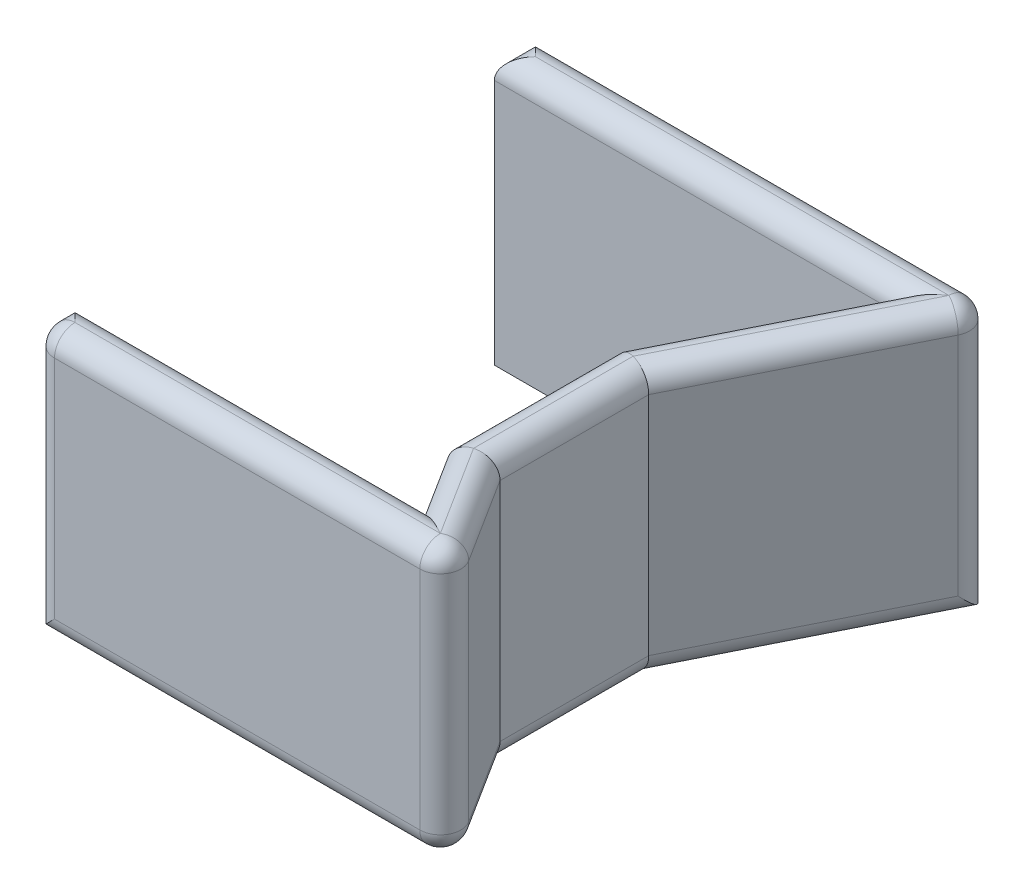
ISO-10303-21;
HEADER;
FILE_DESCRIPTION(('STEP AP214'),'2;1');
FILE_NAME('part.step','',(''),(''),'','','');
FILE_SCHEMA(('AUTOMOTIVE_DESIGN { 1 0 10303 214 1 1 1 1 }'));
ENDSEC;
DATA;
#1=APPLICATION_CONTEXT('core data for automotive mechanical design processes');
#2=APPLICATION_PROTOCOL_DEFINITION('international standard','automotive_design',2000,#1);
#3=PRODUCT_CONTEXT('',#1,'mechanical');
#4=PRODUCT('Part','Part','',(#3));
#5=PRODUCT_RELATED_PRODUCT_CATEGORY('part','',(#4));
#6=PRODUCT_DEFINITION_FORMATION('','',#4);
#7=PRODUCT_DEFINITION_CONTEXT('part definition',#1,'design');
#8=PRODUCT_DEFINITION('design','',#6,#7);
#9=PRODUCT_DEFINITION_SHAPE('','',#8);
#10=(LENGTH_UNIT() NAMED_UNIT(*) SI_UNIT(.MILLI.,.METRE.));
#11=(NAMED_UNIT(*) PLANE_ANGLE_UNIT() SI_UNIT($,.RADIAN.));
#12=(NAMED_UNIT(*) SI_UNIT($,.STERADIAN.) SOLID_ANGLE_UNIT());
#13=UNCERTAINTY_MEASURE_WITH_UNIT(LENGTH_MEASURE(1.E-05),#10,'distance_accuracy_value','');
#14=(GEOMETRIC_REPRESENTATION_CONTEXT(3) GLOBAL_UNCERTAINTY_ASSIGNED_CONTEXT((#13)) GLOBAL_UNIT_ASSIGNED_CONTEXT((#10,
#11,#12)) REPRESENTATION_CONTEXT('',''));
#15=CARTESIAN_POINT('',(0.,0.,0.));
#16=DIRECTION('',(0.,0.,1.));
#17=DIRECTION('',(1.,0.,0.));
#18=AXIS2_PLACEMENT_3D('',#15,#16,#17);
#19=CARTESIAN_POINT('',(12.0356371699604,130.,49.1694012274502));
#20=DIRECTION('',(0.,0.,1.));
#21=DIRECTION('',(1.,0.,0.));
#22=AXIS2_PLACEMENT_3D('',#19,#20,#21);
#23=PLANE('',#22);
#24=DIRECTION('',(0.,-1.,0.));
#25=VECTOR('',#24,1.);
#26=CARTESIAN_POINT('',(-175.757482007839,130.,49.1694012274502));
#27=LINE('',#26,#25);
#28=CARTESIAN_POINT('',(-175.757482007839,120.,49.1694012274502));
#29=VERTEX_POINT('',#28);
#30=CARTESIAN_POINT('',(-175.757482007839,0.,49.1694012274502));
#31=VERTEX_POINT('',#30);
#32=EDGE_CURVE('E339',#29,#31,#27,.T.);
#33=ORIENTED_EDGE('',*,*,#32,.F.);
#34=DIRECTION('',(-1.,0.,0.));
#35=VECTOR('',#34,1.);
#36=CARTESIAN_POINT('',(12.0356371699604,120.,49.1694012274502));
#37=LINE('',#36,#35);
#38=CARTESIAN_POINT('',(-6.12149708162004,120.,49.1694012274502));
#39=VERTEX_POINT('',#38);
#40=EDGE_CURVE('E356',#29,#39,#37,.F.);
#41=ORIENTED_EDGE('',*,*,#40,.T.);
#42=DIRECTION('',(0.,-1.,0.));
#43=VECTOR('',#42,1.);
#44=CARTESIAN_POINT('',(-6.12149708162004,130.,49.1694012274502));
#45=LINE('',#44,#43);
#46=CARTESIAN_POINT('',(-6.12149708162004,0.,49.1694012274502));
#47=VERTEX_POINT('',#46);
#48=EDGE_CURVE('E327',#39,#47,#45,.T.);
#49=ORIENTED_EDGE('',*,*,#48,.T.);
#50=DIRECTION('',(-1.,0.,0.));
#51=VECTOR('',#50,1.);
#52=CARTESIAN_POINT('',(12.0356371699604,0.,49.1694012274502));
#53=LINE('',#52,#51);
#54=EDGE_CURVE('E298',#47,#31,#53,.T.);
#55=ORIENTED_EDGE('',*,*,#54,.T.);
#56=EDGE_LOOP('',(#33,#41,#49,#55));
#57=FACE_BOUND('',#56,.T.);
#58=ADVANCED_FACE('F33',(#57),#23,.F.);
#59=CARTESIAN_POINT('',(-175.757482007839,130.,69.1694012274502));
#60=DIRECTION('',(-1.,0.,0.));
#61=DIRECTION('',(0.,0.,1.));
#62=AXIS2_PLACEMENT_3D('',#59,#60,#61);
#63=PLANE('',#62);
#64=DIRECTION('',(0.,-1.,0.));
#65=VECTOR('',#64,1.);
#66=CARTESIAN_POINT('',(-175.757482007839,130.,59.1694012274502));
#67=LINE('',#66,#65);
#68=CARTESIAN_POINT('',(-175.757482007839,0.,59.1694012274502));
#69=VERTEX_POINT('',#68);
#70=CARTESIAN_POINT('',(-175.757482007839,120.,59.1694012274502));
#71=VERTEX_POINT('',#70);
#72=EDGE_CURVE('E358',#69,#71,#67,.F.);
#73=ORIENTED_EDGE('',*,*,#72,.T.);
#74=DIRECTION('',(0.,0.,-1.));
#75=VECTOR('',#74,1.);
#76=CARTESIAN_POINT('',(-175.757482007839,120.,49.1694012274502));
#77=LINE('',#76,#75);
#78=EDGE_CURVE('E360',#71,#29,#77,.T.);
#79=ORIENTED_EDGE('',*,*,#78,.T.);
#80=ORIENTED_EDGE('',*,*,#32,.T.);
#81=DIRECTION('',(0.,0.,-1.));
#82=VECTOR('',#81,1.);
#83=CARTESIAN_POINT('',(-175.757482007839,0.,69.1694012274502));
#84=LINE('',#83,#82);
#85=EDGE_CURVE('E91',#69,#31,#84,.T.);
#86=ORIENTED_EDGE('',*,*,#85,.F.);
#87=EDGE_LOOP('',(#73,#79,#80,#86));
#88=FACE_BOUND('',#87,.T.);
#89=ADVANCED_FACE('F449',(#88),#63,.T.);
#90=CARTESIAN_POINT('',(12.0356371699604,130.,69.1694012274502));
#91=DIRECTION('',(0.,0.,1.));
#92=DIRECTION('',(1.,0.,0.));
#93=AXIS2_PLACEMENT_3D('',#90,#91,#92);
#94=PLANE('',#93);
#95=DIRECTION('',(0.,-1.,0.));
#96=VECTOR('',#95,1.);
#97=CARTESIAN_POINT('',(12.0356371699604,130.,69.1694012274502));
#98=LINE('',#97,#96);
#99=CARTESIAN_POINT('',(12.0356371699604,10.,69.1694012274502));
#100=VERTEX_POINT('',#99);
#101=CARTESIAN_POINT('',(12.0356371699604,120.,69.1694012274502));
#102=VERTEX_POINT('',#101);
#103=EDGE_CURVE('E362',#100,#102,#98,.F.);
#104=ORIENTED_EDGE('',*,*,#103,.T.);
#105=DIRECTION('',(-1.,0.,0.));
#106=VECTOR('',#105,1.);
#107=CARTESIAN_POINT('',(-175.757482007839,120.,69.1694012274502));
#108=LINE('',#107,#106);
#109=CARTESIAN_POINT('',(-165.757482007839,120.,69.1694012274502));
#110=VERTEX_POINT('',#109);
#111=EDGE_CURVE('E368',#102,#110,#108,.T.);
#112=ORIENTED_EDGE('',*,*,#111,.T.);
#113=DIRECTION('',(0.,-1.,0.));
#114=VECTOR('',#113,1.);
#115=CARTESIAN_POINT('',(-165.757482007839,130.,69.1694012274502));
#116=LINE('',#115,#114);
#117=CARTESIAN_POINT('',(-165.757482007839,10.,69.1694012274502));
#118=VERTEX_POINT('',#117);
#119=EDGE_CURVE('E366',#110,#118,#116,.T.);
#120=ORIENTED_EDGE('',*,*,#119,.T.);
#121=DIRECTION('',(-1.,0.,0.));
#122=VECTOR('',#121,1.);
#123=CARTESIAN_POINT('',(12.0356371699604,9.99999999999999,69.1694012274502));
#124=LINE('',#123,#122);
#125=EDGE_CURVE('E364',#118,#100,#124,.F.);
#126=ORIENTED_EDGE('',*,*,#125,.T.);
#127=EDGE_LOOP('',(#104,#112,#120,#126));
#128=FACE_BOUND('',#127,.T.);
#129=ADVANCED_FACE('F444',(#128),#94,.T.);
#130=CARTESIAN_POINT('',(-7.29655389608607,130.,9.89613446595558));
#131=DIRECTION('',(0.845143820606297,0.,-0.53453898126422));
#132=DIRECTION('',(-0.53453898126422,0.,-0.845143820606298));
#133=AXIS2_PLACEMENT_3D('',#130,#131,#132);
#134=PLANE('',#133);
#135=DIRECTION('',(0.,-1.,0.));
#136=VECTOR('',#135,1.);
#137=CARTESIAN_POINT('',(20.4870753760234,130.,53.824011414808));
#138=LINE('',#137,#136);
#139=CARTESIAN_POINT('',(20.4870753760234,120.,53.824011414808));
#140=VERTEX_POINT('',#139);
#141=CARTESIAN_POINT('',(20.4870753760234,10.,53.824011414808));
#142=VERTEX_POINT('',#141);
#143=EDGE_CURVE('E379',#140,#142,#138,.T.);
#144=ORIENTED_EDGE('',*,*,#143,.T.);
#145=DIRECTION('',(0.53453898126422,0.,0.845143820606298));
#146=VECTOR('',#145,1.);
#147=CARTESIAN_POINT('',(-7.29655389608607,9.99999999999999,9.89613446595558));
#148=LINE('',#147,#146);
#149=CARTESIAN_POINT('',(-5.74799210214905,10.,12.3445198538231));
#150=VERTEX_POINT('',#149);
#151=EDGE_CURVE('E383',#142,#150,#148,.F.);
#152=ORIENTED_EDGE('',*,*,#151,.T.);
#153=DIRECTION('',(0.,-1.,0.));
#154=VECTOR('',#153,1.);
#155=CARTESIAN_POINT('',(-5.74799210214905,130.,12.3445198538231));
#156=LINE('',#155,#154);
#157=CARTESIAN_POINT('',(-5.74799210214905,120.,12.3445198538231));
#158=VERTEX_POINT('',#157);
#159=EDGE_CURVE('E190',#158,#150,#156,.T.);
#160=ORIENTED_EDGE('',*,*,#159,.F.);
#161=DIRECTION('',(0.53453898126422,0.,0.845143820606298));
#162=VECTOR('',#161,1.);
#163=CARTESIAN_POINT('',(30.1927714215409,120.,69.1694012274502));
#164=LINE('',#163,#162);
#165=EDGE_CURVE('E381',#158,#140,#164,.T.);
#166=ORIENTED_EDGE('',*,*,#165,.T.);
#167=EDGE_LOOP('',(#144,#152,#160,#166));
#168=FACE_BOUND('',#167,.T.);
#169=ADVANCED_FACE('F389',(#168),#134,.T.);
#170=CARTESIAN_POINT('',(-5.74799210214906,130.,-62.3879597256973));
#171=DIRECTION('',(1.,0.,0.));
#172=DIRECTION('',(0.,0.,-1.));
#173=AXIS2_PLACEMENT_3D('',#170,#171,#172);
#174=PLANE('',#173);
#175=ORIENTED_EDGE('',*,*,#159,.T.);
#176=DIRECTION('',(0.,0.,1.));
#177=VECTOR('',#176,1.);
#178=CARTESIAN_POINT('',(-5.74799210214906,9.99999999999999,-62.3879597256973));
#179=LINE('',#178,#177);
#180=CARTESIAN_POINT('',(-5.74799210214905,10.,-60.0284061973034));
#181=VERTEX_POINT('',#180);
#182=EDGE_CURVE('E184',#150,#181,#179,.F.);
#183=ORIENTED_EDGE('',*,*,#182,.T.);
#184=DIRECTION('',(0.,-1.,0.));
#185=VECTOR('',#184,1.);
#186=CARTESIAN_POINT('',(-5.74799210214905,130.,-60.0284061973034));
#187=LINE('',#186,#185);
#188=CARTESIAN_POINT('',(-5.74799210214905,120.,-60.0284061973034));
#189=VERTEX_POINT('',#188);
#190=EDGE_CURVE('E187',#189,#181,#187,.T.);
#191=ORIENTED_EDGE('',*,*,#190,.F.);
#192=DIRECTION('',(0.,0.,1.));
#193=VECTOR('',#192,1.);
#194=CARTESIAN_POINT('',(-5.74799210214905,120.,12.344519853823));
#195=LINE('',#194,#193);
#196=EDGE_CURVE('E195',#189,#158,#195,.T.);
#197=ORIENTED_EDGE('',*,*,#196,.T.);
#198=EDGE_LOOP('',(#175,#183,#191,#197));
#199=FACE_BOUND('',#198,.T.);
#200=ADVANCED_FACE('F186',(#199),#174,.T.);
#201=CARTESIAN_POINT('',(44.4255630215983,130.,-160.429065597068));
#202=DIRECTION('',(0.894522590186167,0.,0.447022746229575));
#203=DIRECTION('',(0.447022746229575,0.,-0.894522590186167));
#204=AXIS2_PLACEMENT_3D('',#201,#202,#203);
#205=PLANE('',#204);
#206=ORIENTED_EDGE('',*,*,#190,.T.);
#207=DIRECTION('',(-0.447022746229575,0.,0.894522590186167));
#208=VECTOR('',#207,1.);
#209=CARTESIAN_POINT('',(44.4255630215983,9.99999999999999,-160.429065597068));
#210=LINE('',#209,#208);
#211=CARTESIAN_POINT('',(44.4255630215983,10.,-160.429065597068));
#212=VERTEX_POINT('',#211);
#213=EDGE_CURVE('E11',#181,#212,#210,.F.);
#214=ORIENTED_EDGE('',*,*,#213,.T.);
#215=DIRECTION('',(0.,-1.,0.));
#216=VECTOR('',#215,1.);
#217=CARTESIAN_POINT('',(44.4255630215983,130.,-160.429065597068));
#218=LINE('',#217,#216);
#219=CARTESIAN_POINT('',(44.4255630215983,120.,-160.429065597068));
#220=VERTEX_POINT('',#219);
#221=EDGE_CURVE('E51',#212,#220,#218,.F.);
#222=ORIENTED_EDGE('',*,*,#221,.T.);
#223=DIRECTION('',(-0.447022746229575,0.,0.894522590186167));
#224=VECTOR('',#223,1.);
#225=CARTESIAN_POINT('',(-5.74799210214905,120.,-60.0284061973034));
#226=LINE('',#225,#224);
#227=EDGE_CURVE('E43',#220,#189,#226,.T.);
#228=ORIENTED_EDGE('',*,*,#227,.T.);
#229=EDGE_LOOP('',(#206,#214,#222,#228));
#230=FACE_BOUND('',#229,.T.);
#231=ADVANCED_FACE('F197',(#230),#205,.T.);
#232=CARTESIAN_POINT('',(-175.757482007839,130.,-174.899293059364));
#233=DIRECTION('',(0.,0.,-1.));
#234=DIRECTION('',(-1.,0.,0.));
#235=AXIS2_PLACEMENT_3D('',#232,#233,#234);
#236=PLANE('',#235);
#237=DIRECTION('',(0.,-1.,0.));
#238=VECTOR('',#237,1.);
#239=CARTESIAN_POINT('',(-175.757482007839,130.,-174.899293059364));
#240=LINE('',#239,#238);
#241=CARTESIAN_POINT('',(-175.757482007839,120.,-174.899293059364));
#242=VERTEX_POINT('',#241);
#243=CARTESIAN_POINT('',(-175.757482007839,0.,-174.899293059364));
#244=VERTEX_POINT('',#243);
#245=EDGE_CURVE('E200',#242,#244,#240,.T.);
#246=ORIENTED_EDGE('',*,*,#245,.F.);
#247=DIRECTION('',(1.,0.,0.));
#248=VECTOR('',#247,1.);
#249=CARTESIAN_POINT('',(51.6568178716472,120.,-174.899293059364));
#250=LINE('',#249,#248);
#251=CARTESIAN_POINT('',(35.4803371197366,120.,-174.899293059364));
#252=VERTEX_POINT('',#251);
#253=EDGE_CURVE('E343',#242,#252,#250,.T.);
#254=ORIENTED_EDGE('',*,*,#253,.T.);
#255=DIRECTION('',(0.,-1.,0.));
#256=VECTOR('',#255,1.);
#257=CARTESIAN_POINT('',(35.4803371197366,130.,-174.899293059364));
#258=LINE('',#257,#256);
#259=CARTESIAN_POINT('',(35.4803371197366,0.,-174.899293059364));
#260=VERTEX_POINT('',#259);
#261=EDGE_CURVE('E341',#252,#260,#258,.T.);
#262=ORIENTED_EDGE('',*,*,#261,.T.);
#263=DIRECTION('',(1.,0.,0.));
#264=VECTOR('',#263,1.);
#265=CARTESIAN_POINT('',(-175.757482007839,0.,-174.899293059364));
#266=LINE('',#265,#264);
#267=EDGE_CURVE('E307',#244,#260,#266,.T.);
#268=ORIENTED_EDGE('',*,*,#267,.F.);
#269=EDGE_LOOP('',(#246,#254,#262,#268));
#270=FACE_BOUND('',#269,.T.);
#271=ADVANCED_FACE('F691',(#270),#236,.T.);
#272=CARTESIAN_POINT('',(-175.757482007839,130.,-154.899293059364));
#273=DIRECTION('',(-1.,0.,0.));
#274=DIRECTION('',(0.,0.,1.));
#275=AXIS2_PLACEMENT_3D('',#272,#273,#274);
#276=PLANE('',#275);
#277=DIRECTION('',(0.,-1.,0.));
#278=VECTOR('',#277,1.);
#279=CARTESIAN_POINT('',(-175.757482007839,130.,-154.899293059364));
#280=LINE('',#279,#278);
#281=CARTESIAN_POINT('',(-175.757482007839,120.,-154.899293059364));
#282=VERTEX_POINT('',#281);
#283=CARTESIAN_POINT('',(-175.757482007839,0.,-154.899293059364));
#284=VERTEX_POINT('',#283);
#285=EDGE_CURVE('E335',#282,#284,#280,.T.);
#286=ORIENTED_EDGE('',*,*,#285,.F.);
#287=DIRECTION('',(0.,0.,-1.));
#288=VECTOR('',#287,1.);
#289=CARTESIAN_POINT('',(-175.757482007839,120.,-174.899293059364));
#290=LINE('',#289,#288);
#291=EDGE_CURVE('E346',#282,#242,#290,.T.);
#292=ORIENTED_EDGE('',*,*,#291,.T.);
#293=ORIENTED_EDGE('',*,*,#245,.T.);
#294=DIRECTION('',(0.,0.,-1.));
#295=VECTOR('',#294,1.);
#296=CARTESIAN_POINT('',(-175.757482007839,0.,-154.899293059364));
#297=LINE('',#296,#295);
#298=EDGE_CURVE('E312',#284,#244,#297,.T.);
#299=ORIENTED_EDGE('',*,*,#298,.F.);
#300=EDGE_LOOP('',(#286,#292,#293,#299));
#301=FACE_BOUND('',#300,.T.);
#302=ADVANCED_FACE('F683',(#301),#276,.T.);
#303=CARTESIAN_POINT('',(-175.757482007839,130.,-154.899293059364));
#304=DIRECTION('',(0.,0.,-1.));
#305=DIRECTION('',(-1.,0.,0.));
#306=AXIS2_PLACEMENT_3D('',#303,#304,#305);
#307=PLANE('',#306);
#308=DIRECTION('',(0.,-1.,0.));
#309=VECTOR('',#308,1.);
#310=CARTESIAN_POINT('',(19.303856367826,130.,-154.899293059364));
#311=LINE('',#310,#309);
#312=CARTESIAN_POINT('',(19.303856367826,120.,-154.899293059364));
#313=VERTEX_POINT('',#312);
#314=CARTESIAN_POINT('',(19.303856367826,0.,-154.899293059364));
#315=VERTEX_POINT('',#314);
#316=EDGE_CURVE('E333',#313,#315,#311,.T.);
#317=ORIENTED_EDGE('',*,*,#316,.F.);
#318=DIRECTION('',(1.,0.,0.));
#319=VECTOR('',#318,1.);
#320=CARTESIAN_POINT('',(-175.757482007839,120.,-154.899293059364));
#321=LINE('',#320,#319);
#322=EDGE_CURVE('E348',#313,#282,#321,.F.);
#323=ORIENTED_EDGE('',*,*,#322,.T.);
#324=ORIENTED_EDGE('',*,*,#285,.T.);
#325=DIRECTION('',(1.,0.,0.));
#326=VECTOR('',#325,1.);
#327=CARTESIAN_POINT('',(-175.757482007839,0.,-154.899293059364));
#328=LINE('',#327,#326);
#329=EDGE_CURVE('E315',#284,#315,#328,.T.);
#330=ORIENTED_EDGE('',*,*,#329,.T.);
#331=EDGE_LOOP('',(#317,#323,#324,#330));
#332=FACE_BOUND('',#331,.T.);
#333=ADVANCED_FACE('F412',(#332),#307,.F.);
#334=CARTESIAN_POINT('',(26.5351112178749,130.,-169.369520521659));
#335=DIRECTION('',(0.894522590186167,0.,0.447022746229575));
#336=DIRECTION('',(0.447022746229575,0.,-0.894522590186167));
#337=AXIS2_PLACEMENT_3D('',#334,#335,#336);
#338=PLANE('',#337);
#339=DIRECTION('',(0.,-1.,0.));
#340=VECTOR('',#339,1.);
#341=CARTESIAN_POINT('',(-25.7479921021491,130.,-64.7475132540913));
#342=LINE('',#341,#340);
#343=CARTESIAN_POINT('',(-25.7479921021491,120.,-64.7475132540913));
#344=VERTEX_POINT('',#343);
#345=CARTESIAN_POINT('',(-25.7479921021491,0.,-64.7475132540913));
#346=VERTEX_POINT('',#345);
#347=EDGE_CURVE('E331',#344,#346,#342,.T.);
#348=ORIENTED_EDGE('',*,*,#347,.F.);
#349=DIRECTION('',(-0.447022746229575,0.,0.894522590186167));
#350=VECTOR('',#349,1.);
#351=CARTESIAN_POINT('',(26.5351112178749,120.,-169.369520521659));
#352=LINE('',#351,#350);
#353=EDGE_CURVE('E350',#344,#313,#352,.F.);
#354=ORIENTED_EDGE('',*,*,#353,.T.);
#355=ORIENTED_EDGE('',*,*,#316,.T.);
#356=DIRECTION('',(-0.447022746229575,0.,0.894522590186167));
#357=VECTOR('',#356,1.);
#358=CARTESIAN_POINT('',(26.5351112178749,0.,-169.369520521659));
#359=LINE('',#358,#357);
#360=EDGE_CURVE('E318',#315,#346,#359,.T.);
#361=ORIENTED_EDGE('',*,*,#360,.T.);
#362=EDGE_LOOP('',(#348,#354,#355,#361));
#363=FACE_BOUND('',#362,.T.);
#364=ADVANCED_FACE('F410',(#363),#338,.F.);
#365=CARTESIAN_POINT('',(-25.7479921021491,130.,-62.3879597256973));
#366=DIRECTION('',(1.,0.,0.));
#367=DIRECTION('',(0.,0.,-1.));
#368=AXIS2_PLACEMENT_3D('',#365,#366,#367);
#369=PLANE('',#368);
#370=DIRECTION('',(0.,-1.,0.));
#371=VECTOR('',#370,1.);
#372=CARTESIAN_POINT('',(-25.747992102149,130.,18.1385287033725));
#373=LINE('',#372,#371);
#374=CARTESIAN_POINT('',(-25.747992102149,120.,18.1385287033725));
#375=VERTEX_POINT('',#374);
#376=CARTESIAN_POINT('',(-25.747992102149,0.,18.1385287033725));
#377=VERTEX_POINT('',#376);
#378=EDGE_CURVE('E329',#375,#377,#373,.T.);
#379=ORIENTED_EDGE('',*,*,#378,.F.);
#380=DIRECTION('',(0.,0.,1.));
#381=VECTOR('',#380,1.);
#382=CARTESIAN_POINT('',(-25.7479921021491,120.,-62.3879597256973));
#383=LINE('',#382,#381);
#384=EDGE_CURVE('E352',#375,#344,#383,.F.);
#385=ORIENTED_EDGE('',*,*,#384,.T.);
#386=ORIENTED_EDGE('',*,*,#347,.T.);
#387=DIRECTION('',(0.,0.,1.));
#388=VECTOR('',#387,1.);
#389=CARTESIAN_POINT('',(-25.7479921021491,0.,-62.3879597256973));
#390=LINE('',#389,#388);
#391=EDGE_CURVE('E321',#346,#377,#390,.T.);
#392=ORIENTED_EDGE('',*,*,#391,.T.);
#393=EDGE_LOOP('',(#379,#385,#386,#392));
#394=FACE_BOUND('',#393,.T.);
#395=ADVANCED_FACE('F422',(#394),#369,.F.);
#396=CARTESIAN_POINT('',(-24.199430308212,130.,20.58691409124));
#397=DIRECTION('',(0.845143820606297,0.,-0.53453898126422));
#398=DIRECTION('',(-0.53453898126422,0.,-0.845143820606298));
#399=AXIS2_PLACEMENT_3D('',#396,#397,#398);
#400=PLANE('',#399);
#401=ORIENTED_EDGE('',*,*,#48,.F.);
#402=DIRECTION('',(0.53453898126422,0.,0.845143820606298));
#403=VECTOR('',#402,1.);
#404=CARTESIAN_POINT('',(-24.199430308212,120.,20.58691409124));
#405=LINE('',#404,#403);
#406=EDGE_CURVE('E354',#39,#375,#405,.F.);
#407=ORIENTED_EDGE('',*,*,#406,.T.);
#408=ORIENTED_EDGE('',*,*,#378,.T.);
#409=DIRECTION('',(0.53453898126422,0.,0.845143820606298));
#410=VECTOR('',#409,1.);
#411=CARTESIAN_POINT('',(-24.199430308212,0.,20.58691409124));
#412=LINE('',#411,#410);
#413=EDGE_CURVE('E324',#377,#47,#412,.T.);
#414=ORIENTED_EDGE('',*,*,#413,.T.);
#415=EDGE_LOOP('',(#401,#407,#408,#414));
#416=FACE_BOUND('',#415,.T.);
#417=ADVANCED_FACE('F654',(#416),#400,.F.);
#418=CARTESIAN_POINT('',(0.,0.,0.));
#419=DIRECTION('',(0.,-1.,0.));
#420=DIRECTION('',(-1.,0.,0.));
#421=AXIS2_PLACEMENT_3D('',#418,#419,#420);
#422=PLANE('',#421);
#423=DIRECTION('',(0.53453898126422,0.,0.845143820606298));
#424=VECTOR('',#423,1.);
#425=CARTESIAN_POINT('',(-18.1338343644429,0.,11.4693394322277));
#426=LINE('',#425,#424);
#427=CARTESIAN_POINT('',(-15.747992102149,0.,15.2415242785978));
#428=VERTEX_POINT('',#427);
#429=CARTESIAN_POINT('',(12.0356371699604,0.,59.1694012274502));
#430=VERTEX_POINT('',#429);
#431=EDGE_CURVE('E375',#428,#430,#426,.T.);
#432=ORIENTED_EDGE('',*,*,#431,.T.);
#433=DIRECTION('',(-1.,0.,0.));
#434=VECTOR('',#433,1.);
#435=CARTESIAN_POINT('',(0.,0.,59.1694012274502));
#436=LINE('',#435,#434);
#437=EDGE_CURVE('E377',#430,#69,#436,.T.);
#438=ORIENTED_EDGE('',*,*,#437,.T.);
#439=ORIENTED_EDGE('',*,*,#85,.T.);
#440=ORIENTED_EDGE('',*,*,#54,.F.);
#441=ORIENTED_EDGE('',*,*,#413,.F.);
#442=ORIENTED_EDGE('',*,*,#391,.F.);
#443=ORIENTED_EDGE('',*,*,#360,.F.);
#444=ORIENTED_EDGE('',*,*,#329,.F.);
#445=ORIENTED_EDGE('',*,*,#298,.T.);
#446=ORIENTED_EDGE('',*,*,#267,.T.);
#447=CARTESIAN_POINT('',(35.4803371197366,0.,-164.899293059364));
#448=DIRECTION('',(0.,-1.,0.));
#449=DIRECTION('',(0.,0.,-1.));
#450=AXIS2_PLACEMENT_3D('',#447,#448,#449);
#451=CIRCLE('',#450,10.);
#452=CARTESIAN_POINT('',(39.9505645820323,0.,-173.844518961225));
#453=VERTEX_POINT('',#452);
#454=EDGE_CURVE('E371',#260,#453,#451,.T.);
#455=ORIENTED_EDGE('',*,*,#454,.T.);
#456=DIRECTION('',(-0.447022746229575,0.,0.894522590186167));
#457=VECTOR('',#456,1.);
#458=CARTESIAN_POINT('',(-37.5482760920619,0.,-18.7641247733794));
#459=LINE('',#458,#457);
#460=CARTESIAN_POINT('',(-15.7479921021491,0.,-62.3879597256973));
#461=VERTEX_POINT('',#460);
#462=EDGE_CURVE('E215',#453,#461,#459,.T.);
#463=ORIENTED_EDGE('',*,*,#462,.T.);
#464=DIRECTION('',(0.,0.,1.));
#465=VECTOR('',#464,1.);
#466=CARTESIAN_POINT('',(-15.747992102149,0.,0.));
#467=LINE('',#466,#465);
#468=EDGE_CURVE('E206',#461,#428,#467,.T.);
#469=ORIENTED_EDGE('',*,*,#468,.T.);
#470=EDGE_LOOP('',(#432,#438,#439,#440,#441,#442,#443,#444,#445,#446,#455,#463,#469));
#471=FACE_BOUND('',#470,.T.);
#472=ADVANCED_FACE('F418',(#471),#422,.T.);
#473=CARTESIAN_POINT('',(-165.757482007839,130.,59.1694012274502));
#474=DIRECTION('',(0.,-1.,0.));
#475=DIRECTION('',(0.,0.,-1.));
#476=AXIS2_PLACEMENT_3D('',#473,#474,#475);
#477=CYLINDRICAL_SURFACE('',#476,10.);
#478=CARTESIAN_POINT('',(-165.757482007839,120.,59.1694012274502));
#479=DIRECTION('',(0.,1.,0.));
#480=DIRECTION('',(0.,0.,1.));
#481=AXIS2_PLACEMENT_3D('',#478,#479,#480);
#482=CIRCLE('',#481,10.);
#483=EDGE_CURVE('E292',#71,#110,#482,.T.);
#484=ORIENTED_EDGE('',*,*,#483,.F.);
#485=ORIENTED_EDGE('',*,*,#72,.F.);
#486=CARTESIAN_POINT('',(-165.757482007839,10.,59.1694012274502));
#487=DIRECTION('',(-0.707106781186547,0.707106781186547,0.));
#488=DIRECTION('',(-0.707106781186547,-0.707106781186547,0.));
#489=AXIS2_PLACEMENT_3D('',#486,#487,#488);
#490=ELLIPSE('',#489,14.1421356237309,10.);
#491=EDGE_CURVE('E37',#118,#69,#490,.F.);
#492=ORIENTED_EDGE('',*,*,#491,.F.);
#493=ORIENTED_EDGE('',*,*,#119,.F.);
#494=EDGE_LOOP('',(#484,#485,#492,#493));
#495=FACE_BOUND('',#494,.T.);
#496=ADVANCED_FACE('F35',(#495),#477,.T.);
#497=CARTESIAN_POINT('',(0.,10.,59.1694012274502));
#498=DIRECTION('',(-1.,0.,0.));
#499=DIRECTION('',(0.,0.,1.));
#500=AXIS2_PLACEMENT_3D('',#497,#498,#499);
#501=CYLINDRICAL_SURFACE('',#500,10.);
#502=ORIENTED_EDGE('',*,*,#491,.T.);
#503=ORIENTED_EDGE('',*,*,#437,.F.);
#504=CARTESIAN_POINT('',(12.0356371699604,10.,59.1694012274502));
#505=DIRECTION('',(1.,0.,0.));
#506=DIRECTION('',(0.,1.,0.));
#507=AXIS2_PLACEMENT_3D('',#504,#505,#506);
#508=CIRCLE('',#507,10.);
#509=EDGE_CURVE('E289',#100,#430,#508,.T.);
#510=ORIENTED_EDGE('',*,*,#509,.F.);
#511=ORIENTED_EDGE('',*,*,#125,.F.);
#512=EDGE_LOOP('',(#502,#503,#510,#511));
#513=FACE_BOUND('',#512,.T.);
#514=ADVANCED_FACE('F442',(#513),#501,.T.);
#515=CARTESIAN_POINT('',(-165.757482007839,120.,59.1694012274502));
#516=DIRECTION('',(0.,0.,1.));
#517=DIRECTION('',(1.,0.,0.));
#518=AXIS2_PLACEMENT_3D('',#515,#516,#517);
#519=SPHERICAL_SURFACE('',#518,10.);
#520=CARTESIAN_POINT('',(-165.757482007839,120.,59.1694012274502));
#521=DIRECTION('',(0.,0.,1.));
#522=DIRECTION('',(1.,0.,0.));
#523=AXIS2_PLACEMENT_3D('',#520,#521,#522);
#524=CIRCLE('',#523,10.);
#525=CARTESIAN_POINT('',(-165.757482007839,130.,59.1694012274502));
#526=VERTEX_POINT('',#525);
#527=EDGE_CURVE('E82',#71,#526,#524,.F.);
#528=ORIENTED_EDGE('',*,*,#527,.F.);
#529=ORIENTED_EDGE('',*,*,#483,.T.);
#530=CARTESIAN_POINT('',(-165.757482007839,120.,59.1694012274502));
#531=DIRECTION('',(-1.,0.,0.));
#532=DIRECTION('',(0.,0.,1.));
#533=AXIS2_PLACEMENT_3D('',#530,#531,#532);
#534=CIRCLE('',#533,10.);
#535=EDGE_CURVE('E284',#526,#110,#534,.F.);
#536=ORIENTED_EDGE('',*,*,#535,.F.);
#537=EDGE_LOOP('',(#528,#529,#536));
#538=FACE_BOUND('',#537,.T.);
#539=ADVANCED_FACE('F627',(#538),#519,.T.);
#540=CARTESIAN_POINT('',(-165.757482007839,120.,69.1694012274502));
#541=DIRECTION('',(0.,0.,1.));
#542=DIRECTION('',(1.,0.,0.));
#543=AXIS2_PLACEMENT_3D('',#540,#541,#542);
#544=CYLINDRICAL_SURFACE('',#543,10.);
#545=ORIENTED_EDGE('',*,*,#78,.F.);
#546=ORIENTED_EDGE('',*,*,#527,.T.);
#547=CARTESIAN_POINT('',(-165.757482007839,120.,59.1694012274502));
#548=DIRECTION('',(-0.707106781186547,0.,0.707106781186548));
#549=DIRECTION('',(0.707106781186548,0.,0.707106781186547));
#550=AXIS2_PLACEMENT_3D('',#547,#548,#549);
#551=ELLIPSE('',#550,14.1421356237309,10.);
#552=EDGE_CURVE('E281',#29,#526,#551,.F.);
#553=ORIENTED_EDGE('',*,*,#552,.F.);
#554=EDGE_LOOP('',(#545,#546,#553));
#555=FACE_BOUND('',#554,.T.);
#556=ADVANCED_FACE('F451',(#555),#544,.T.);
#557=CARTESIAN_POINT('',(12.0356371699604,10.,59.1694012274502));
#558=DIRECTION('',(0.,0.,1.));
#559=DIRECTION('',(1.,0.,0.));
#560=AXIS2_PLACEMENT_3D('',#557,#558,#559);
#561=SPHERICAL_SURFACE('',#560,10.);
#562=CARTESIAN_POINT('',(12.0356371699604,10.,59.1694012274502));
#563=DIRECTION('',(0.534538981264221,0.,0.845143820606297));
#564=DIRECTION('',(0.845143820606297,0.,-0.534538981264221));
#565=AXIS2_PLACEMENT_3D('',#562,#563,#564);
#566=CIRCLE('',#565,10.);
#567=EDGE_CURVE('E278',#142,#430,#566,.F.);
#568=ORIENTED_EDGE('',*,*,#567,.F.);
#569=CARTESIAN_POINT('',(12.0356371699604,10.,59.1694012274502));
#570=DIRECTION('',(0.,-1.,0.));
#571=DIRECTION('',(0.,0.,-1.));
#572=AXIS2_PLACEMENT_3D('',#569,#570,#571);
#573=CIRCLE('',#572,10.);
#574=EDGE_CURVE('E286',#100,#142,#573,.F.);
#575=ORIENTED_EDGE('',*,*,#574,.F.);
#576=ORIENTED_EDGE('',*,*,#509,.T.);
#577=EDGE_LOOP('',(#568,#575,#576));
#578=FACE_BOUND('',#577,.T.);
#579=ADVANCED_FACE('F437',(#578),#561,.T.);
#580=CARTESIAN_POINT('',(12.0356371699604,130.,59.1694012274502));
#581=DIRECTION('',(0.,-1.,0.));
#582=DIRECTION('',(0.,0.,-1.));
#583=AXIS2_PLACEMENT_3D('',#580,#581,#582);
#584=CYLINDRICAL_SURFACE('',#583,10.);
#585=ORIENTED_EDGE('',*,*,#574,.T.);
#586=ORIENTED_EDGE('',*,*,#143,.F.);
#587=CARTESIAN_POINT('',(12.0356371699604,120.,59.1694012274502));
#588=DIRECTION('',(0.,1.,0.));
#589=DIRECTION('',(0.,0.,1.));
#590=AXIS2_PLACEMENT_3D('',#587,#588,#589);
#591=CIRCLE('',#590,10.);
#592=EDGE_CURVE('E275',#102,#140,#591,.T.);
#593=ORIENTED_EDGE('',*,*,#592,.F.);
#594=ORIENTED_EDGE('',*,*,#103,.F.);
#595=EDGE_LOOP('',(#585,#586,#593,#594));
#596=FACE_BOUND('',#595,.T.);
#597=ADVANCED_FACE('F433',(#596),#584,.T.);
#598=CARTESIAN_POINT('',(12.0356371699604,120.,59.1694012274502));
#599=DIRECTION('',(1.,0.,0.));
#600=DIRECTION('',(0.,0.,-1.));
#601=AXIS2_PLACEMENT_3D('',#598,#599,#600);
#602=CYLINDRICAL_SURFACE('',#601,10.);
#603=DIRECTION('',(-1.,0.,0.));
#604=VECTOR('',#603,1.);
#605=CARTESIAN_POINT('',(30.1927714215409,130.,59.1694012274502));
#606=LINE('',#605,#604);
#607=CARTESIAN_POINT('',(12.0356371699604,130.,59.1694012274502));
#608=VERTEX_POINT('',#607);
#609=EDGE_CURVE('E74',#526,#608,#606,.F.);
#610=ORIENTED_EDGE('',*,*,#609,.F.);
#611=ORIENTED_EDGE('',*,*,#535,.T.);
#612=ORIENTED_EDGE('',*,*,#111,.F.);
#613=CARTESIAN_POINT('',(12.0356371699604,120.,59.1694012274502));
#614=DIRECTION('',(1.,0.,0.));
#615=DIRECTION('',(0.,0.,-1.));
#616=AXIS2_PLACEMENT_3D('',#613,#614,#615);
#617=CIRCLE('',#616,10.);
#618=EDGE_CURVE('E272',#608,#102,#617,.T.);
#619=ORIENTED_EDGE('',*,*,#618,.F.);
#620=EDGE_LOOP('',(#610,#611,#612,#619));
#621=FACE_BOUND('',#620,.T.);
#622=ADVANCED_FACE('F454',(#621),#602,.T.);
#623=CARTESIAN_POINT('',(0.,120.,59.1694012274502));
#624=DIRECTION('',(-1.,0.,0.));
#625=DIRECTION('',(0.,0.,1.));
#626=AXIS2_PLACEMENT_3D('',#623,#624,#625);
#627=CYLINDRICAL_SURFACE('',#626,10.);
#628=ORIENTED_EDGE('',*,*,#552,.T.);
#629=ORIENTED_EDGE('',*,*,#609,.T.);
#630=CARTESIAN_POINT('',(12.0356371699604,120.,59.1694012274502));
#631=DIRECTION('',(-0.482421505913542,0.,0.875939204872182));
#632=DIRECTION('',(0.875939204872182,0.,0.482421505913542));
#633=AXIS2_PLACEMENT_3D('',#630,#631,#632);
#634=ELLIPSE('',#633,20.7287607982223,10.);
#635=EDGE_CURVE('E269',#39,#608,#634,.F.);
#636=ORIENTED_EDGE('',*,*,#635,.F.);
#637=ORIENTED_EDGE('',*,*,#40,.F.);
#638=EDGE_LOOP('',(#628,#629,#636,#637));
#639=FACE_BOUND('',#638,.T.);
#640=ADVANCED_FACE('F452',(#639),#627,.T.);
#641=CARTESIAN_POINT('',(-18.1338343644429,10.,11.4693394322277));
#642=DIRECTION('',(0.53453898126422,0.,0.845143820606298));
#643=DIRECTION('',(0.845143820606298,0.,-0.53453898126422));
#644=AXIS2_PLACEMENT_3D('',#641,#642,#643);
#645=CYLINDRICAL_SURFACE('',#644,10.);
#646=ORIENTED_EDGE('',*,*,#567,.T.);
#647=ORIENTED_EDGE('',*,*,#431,.F.);
#648=CARTESIAN_POINT('',(-15.747992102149,10.,15.2415242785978));
#649=DIRECTION('',(0.278259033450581,0.,0.960506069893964));
#650=DIRECTION('',(0.960506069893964,0.,-0.27825903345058));
#651=AXIS2_PLACEMENT_3D('',#648,#649,#650);
#652=ELLIPSE('',#651,10.4111783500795,10.);
#653=EDGE_CURVE('E267',#150,#428,#652,.F.);
#654=ORIENTED_EDGE('',*,*,#653,.F.);
#655=ORIENTED_EDGE('',*,*,#151,.F.);
#656=EDGE_LOOP('',(#646,#647,#654,#655));
#657=FACE_BOUND('',#656,.T.);
#658=ADVANCED_FACE('F441',(#657),#645,.T.);
#659=CARTESIAN_POINT('',(12.0356371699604,120.,59.1694012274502));
#660=DIRECTION('',(0.,0.,1.));
#661=DIRECTION('',(1.,0.,0.));
#662=AXIS2_PLACEMENT_3D('',#659,#660,#661);
#663=SPHERICAL_SURFACE('',#662,10.);
#664=ORIENTED_EDGE('',*,*,#618,.T.);
#665=ORIENTED_EDGE('',*,*,#592,.T.);
#666=CARTESIAN_POINT('',(12.0356371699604,120.,59.1694012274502));
#667=DIRECTION('',(0.53453898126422,0.,0.845143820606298));
#668=DIRECTION('',(0.845143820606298,0.,-0.53453898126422));
#669=AXIS2_PLACEMENT_3D('',#666,#667,#668);
#670=CIRCLE('',#669,10.);
#671=EDGE_CURVE('E264',#608,#140,#670,.F.);
#672=ORIENTED_EDGE('',*,*,#671,.F.);
#673=EDGE_LOOP('',(#664,#665,#672));
#674=FACE_BOUND('',#673,.T.);
#675=ADVANCED_FACE('F429',(#674),#663,.T.);
#676=CARTESIAN_POINT('',(-18.1338343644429,120.,11.4693394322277));
#677=DIRECTION('',(0.53453898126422,0.,0.845143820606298));
#678=DIRECTION('',(0.845143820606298,0.,-0.53453898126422));
#679=AXIS2_PLACEMENT_3D('',#676,#677,#678);
#680=CYLINDRICAL_SURFACE('',#679,10.);
#681=ORIENTED_EDGE('',*,*,#406,.F.);
#682=ORIENTED_EDGE('',*,*,#635,.T.);
#683=DIRECTION('',(0.53453898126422,0.,0.845143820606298));
#684=VECTOR('',#683,1.);
#685=CARTESIAN_POINT('',(-18.1338343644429,130.,11.4693394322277));
#686=LINE('',#685,#684);
#687=CARTESIAN_POINT('',(-15.747992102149,130.,15.2415242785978));
#688=VERTEX_POINT('',#687);
#689=EDGE_CURVE('E261',#688,#608,#686,.T.);
#690=ORIENTED_EDGE('',*,*,#689,.F.);
#691=CARTESIAN_POINT('',(-15.747992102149,120.,15.2415242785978));
#692=DIRECTION('',(0.278259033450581,0.,0.960506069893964));
#693=DIRECTION('',(0.960506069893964,0.,-0.27825903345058));
#694=AXIS2_PLACEMENT_3D('',#691,#692,#693);
#695=ELLIPSE('',#694,10.4111783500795,10.);
#696=EDGE_CURVE('E209',#375,#688,#695,.F.);
#697=ORIENTED_EDGE('',*,*,#696,.F.);
#698=EDGE_LOOP('',(#681,#682,#690,#697));
#699=FACE_BOUND('',#698,.T.);
#700=ADVANCED_FACE('F426',(#699),#680,.T.);
#701=CARTESIAN_POINT('',(-15.747992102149,10.,0.));
#702=DIRECTION('',(0.,0.,1.));
#703=DIRECTION('',(1.,0.,0.));
#704=AXIS2_PLACEMENT_3D('',#701,#702,#703);
#705=CYLINDRICAL_SURFACE('',#704,10.);
#706=ORIENTED_EDGE('',*,*,#653,.T.);
#707=ORIENTED_EDGE('',*,*,#468,.F.);
#708=CARTESIAN_POINT('',(-15.7479921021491,10.,-62.3879597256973));
#709=DIRECTION('',(-0.229649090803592,0.,0.973273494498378));
#710=DIRECTION('',(0.973273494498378,0.,0.229649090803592));
#711=AXIS2_PLACEMENT_3D('',#708,#709,#710);
#712=ELLIPSE('',#711,10.2746042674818,10.);
#713=EDGE_CURVE('E204',#181,#461,#712,.F.);
#714=ORIENTED_EDGE('',*,*,#713,.F.);
#715=ORIENTED_EDGE('',*,*,#182,.F.);
#716=EDGE_LOOP('',(#706,#707,#714,#715));
#717=FACE_BOUND('',#716,.T.);
#718=ADVANCED_FACE('F205',(#717),#705,.T.);
#719=CARTESIAN_POINT('',(-15.747992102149,120.,15.2415242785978));
#720=DIRECTION('',(-0.53453898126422,0.,-0.845143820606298));
#721=DIRECTION('',(-0.845143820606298,0.,0.53453898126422));
#722=AXIS2_PLACEMENT_3D('',#719,#720,#721);
#723=CYLINDRICAL_SURFACE('',#722,10.);
#724=ORIENTED_EDGE('',*,*,#671,.T.);
#725=ORIENTED_EDGE('',*,*,#165,.F.);
#726=CARTESIAN_POINT('',(-15.747992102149,120.,15.2415242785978));
#727=DIRECTION('',(-0.278259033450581,0.,-0.960506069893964));
#728=DIRECTION('',(0.960506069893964,0.,-0.27825903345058));
#729=AXIS2_PLACEMENT_3D('',#726,#727,#728);
#730=ELLIPSE('',#729,10.4111783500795,10.);
#731=EDGE_CURVE('E210',#688,#158,#730,.T.);
#732=ORIENTED_EDGE('',*,*,#731,.F.);
#733=ORIENTED_EDGE('',*,*,#689,.T.);
#734=EDGE_LOOP('',(#724,#725,#732,#733));
#735=FACE_BOUND('',#734,.T.);
#736=ADVANCED_FACE('F394',(#735),#723,.T.);
#737=CARTESIAN_POINT('',(-15.747992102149,120.,0.));
#738=DIRECTION('',(0.,0.,1.));
#739=DIRECTION('',(1.,0.,0.));
#740=AXIS2_PLACEMENT_3D('',#737,#738,#739);
#741=CYLINDRICAL_SURFACE('',#740,10.);
#742=ORIENTED_EDGE('',*,*,#384,.F.);
#743=ORIENTED_EDGE('',*,*,#696,.T.);
#744=DIRECTION('',(0.,0.,1.));
#745=VECTOR('',#744,1.);
#746=CARTESIAN_POINT('',(-15.747992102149,130.,0.));
#747=LINE('',#746,#745);
#748=CARTESIAN_POINT('',(-15.7479921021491,130.,-62.3879597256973));
#749=VERTEX_POINT('',#748);
#750=EDGE_CURVE('E254',#749,#688,#747,.T.);
#751=ORIENTED_EDGE('',*,*,#750,.F.);
#752=CARTESIAN_POINT('',(-15.7479921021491,120.,-62.3879597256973));
#753=DIRECTION('',(-0.229649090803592,0.,0.973273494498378));
#754=DIRECTION('',(0.973273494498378,0.,0.229649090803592));
#755=AXIS2_PLACEMENT_3D('',#752,#753,#754);
#756=ELLIPSE('',#755,10.2746042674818,10.);
#757=EDGE_CURVE('E218',#344,#749,#756,.F.);
#758=ORIENTED_EDGE('',*,*,#757,.F.);
#759=EDGE_LOOP('',(#742,#743,#751,#758));
#760=FACE_BOUND('',#759,.T.);
#761=ADVANCED_FACE('F400',(#760),#741,.T.);
#762=CARTESIAN_POINT('',(-37.5482760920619,10.,-18.7641247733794));
#763=DIRECTION('',(-0.447022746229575,0.,0.894522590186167));
#764=DIRECTION('',(0.894522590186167,0.,0.447022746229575));
#765=AXIS2_PLACEMENT_3D('',#762,#763,#764);
#766=CYLINDRICAL_SURFACE('',#765,10.);
#767=ORIENTED_EDGE('',*,*,#713,.T.);
#768=ORIENTED_EDGE('',*,*,#462,.F.);
#769=CARTESIAN_POINT('',(35.4803371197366,10.,-164.899293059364));
#770=DIRECTION('',(-0.316092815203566,-0.707106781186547,0.632522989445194));
#771=DIRECTION('',(0.316092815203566,-0.707106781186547,-0.632522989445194));
#772=AXIS2_PLACEMENT_3D('',#769,#770,#771);
#773=ELLIPSE('',#772,14.1421356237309,10.);
#774=EDGE_CURVE('E214',#212,#453,#773,.F.);
#775=ORIENTED_EDGE('',*,*,#774,.F.);
#776=ORIENTED_EDGE('',*,*,#213,.F.);
#777=EDGE_LOOP('',(#767,#768,#775,#776));
#778=FACE_BOUND('',#777,.T.);
#779=ADVANCED_FACE('F212',(#778),#766,.T.);
#780=CARTESIAN_POINT('',(-15.7479921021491,120.,-62.3879597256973));
#781=DIRECTION('',(0.,0.,-1.));
#782=DIRECTION('',(-1.,0.,0.));
#783=AXIS2_PLACEMENT_3D('',#780,#781,#782);
#784=CYLINDRICAL_SURFACE('',#783,10.);
#785=ORIENTED_EDGE('',*,*,#731,.T.);
#786=ORIENTED_EDGE('',*,*,#196,.F.);
#787=CARTESIAN_POINT('',(-15.747992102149,120.,-62.3879597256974));
#788=DIRECTION('',(0.229649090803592,0.,-0.973273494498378));
#789=DIRECTION('',(0.973273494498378,0.,0.229649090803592));
#790=AXIS2_PLACEMENT_3D('',#787,#788,#789);
#791=ELLIPSE('',#790,10.2746042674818,10.);
#792=EDGE_CURVE('E219',#749,#189,#791,.T.);
#793=ORIENTED_EDGE('',*,*,#792,.F.);
#794=ORIENTED_EDGE('',*,*,#750,.T.);
#795=EDGE_LOOP('',(#785,#786,#793,#794));
#796=FACE_BOUND('',#795,.T.);
#797=ADVANCED_FACE('F396',(#796),#784,.T.);
#798=CARTESIAN_POINT('',(-37.5482760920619,120.,-18.7641247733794));
#799=DIRECTION('',(-0.447022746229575,0.,0.894522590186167));
#800=DIRECTION('',(0.894522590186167,0.,0.447022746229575));
#801=AXIS2_PLACEMENT_3D('',#798,#799,#800);
#802=CYLINDRICAL_SURFACE('',#801,10.);
#803=ORIENTED_EDGE('',*,*,#353,.F.);
#804=ORIENTED_EDGE('',*,*,#757,.T.);
#805=DIRECTION('',(-0.447022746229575,0.,0.894522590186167));
#806=VECTOR('',#805,1.);
#807=CARTESIAN_POINT('',(-37.5482760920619,130.,-18.7641247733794));
#808=LINE('',#807,#806);
#809=CARTESIAN_POINT('',(35.4803371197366,130.,-164.899293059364));
#810=VERTEX_POINT('',#809);
#811=EDGE_CURVE('E247',#810,#749,#808,.T.);
#812=ORIENTED_EDGE('',*,*,#811,.F.);
#813=CARTESIAN_POINT('',(35.4803371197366,120.,-164.899293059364));
#814=DIRECTION('',(0.525821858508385,0.,0.850594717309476));
#815=DIRECTION('',(0.850594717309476,0.,-0.525821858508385));
#816=AXIS2_PLACEMENT_3D('',#813,#814,#815);
#817=ELLIPSE('',#816,19.0178476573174,10.);
#818=EDGE_CURVE('E244',#313,#810,#817,.F.);
#819=ORIENTED_EDGE('',*,*,#818,.F.);
#820=EDGE_LOOP('',(#803,#804,#812,#819));
#821=FACE_BOUND('',#820,.T.);
#822=ADVANCED_FACE('F404',(#821),#802,.T.);
#823=CARTESIAN_POINT('',(35.4803371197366,130.,-164.899293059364));
#824=DIRECTION('',(0.,-1.,0.));
#825=DIRECTION('',(0.,0.,-1.));
#826=AXIS2_PLACEMENT_3D('',#823,#824,#825);
#827=CYLINDRICAL_SURFACE('',#826,10.);
#828=ORIENTED_EDGE('',*,*,#454,.F.);
#829=ORIENTED_EDGE('',*,*,#261,.F.);
#830=CARTESIAN_POINT('',(35.4803371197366,120.,-164.899293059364));
#831=DIRECTION('',(0.,1.,0.));
#832=DIRECTION('',(0.,0.,1.));
#833=AXIS2_PLACEMENT_3D('',#830,#831,#832);
#834=CIRCLE('',#833,10.);
#835=EDGE_CURVE('E225',#220,#252,#834,.T.);
#836=ORIENTED_EDGE('',*,*,#835,.F.);
#837=ORIENTED_EDGE('',*,*,#221,.F.);
#838=ORIENTED_EDGE('',*,*,#774,.T.);
#839=EDGE_LOOP('',(#828,#829,#836,#837,#838));
#840=FACE_BOUND('',#839,.T.);
#841=ADVANCED_FACE('F222',(#840),#827,.T.);
#842=CARTESIAN_POINT('',(35.4803371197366,120.,-164.899293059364));
#843=DIRECTION('',(0.447022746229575,0.,-0.894522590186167));
#844=DIRECTION('',(-0.894522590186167,0.,-0.447022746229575));
#845=AXIS2_PLACEMENT_3D('',#842,#843,#844);
#846=CYLINDRICAL_SURFACE('',#845,10.);
#847=ORIENTED_EDGE('',*,*,#792,.T.);
#848=ORIENTED_EDGE('',*,*,#227,.F.);
#849=CARTESIAN_POINT('',(35.4803371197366,120.,-164.899293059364));
#850=DIRECTION('',(0.447022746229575,0.,-0.894522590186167));
#851=DIRECTION('',(-0.894522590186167,0.,-0.447022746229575));
#852=AXIS2_PLACEMENT_3D('',#849,#850,#851);
#853=CIRCLE('',#852,10.);
#854=EDGE_CURVE('E239',#810,#220,#853,.T.);
#855=ORIENTED_EDGE('',*,*,#854,.F.);
#856=ORIENTED_EDGE('',*,*,#811,.T.);
#857=EDGE_LOOP('',(#847,#848,#855,#856));
#858=FACE_BOUND('',#857,.T.);
#859=ADVANCED_FACE('F486',(#858),#846,.T.);
#860=CARTESIAN_POINT('',(0.,120.,-164.899293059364));
#861=DIRECTION('',(1.,0.,0.));
#862=DIRECTION('',(0.,0.,-1.));
#863=AXIS2_PLACEMENT_3D('',#860,#861,#862);
#864=CYLINDRICAL_SURFACE('',#863,10.);
#865=CARTESIAN_POINT('',(-165.757482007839,120.,-164.899293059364));
#866=DIRECTION('',(0.707106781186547,0.,0.707106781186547));
#867=DIRECTION('',(0.707106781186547,0.,-0.707106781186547));
#868=AXIS2_PLACEMENT_3D('',#865,#866,#867);
#869=ELLIPSE('',#868,14.1421356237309,10.);
#870=CARTESIAN_POINT('',(-165.757482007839,130.,-164.899293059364));
#871=VERTEX_POINT('',#870);
#872=EDGE_CURVE('E242',#282,#871,#869,.F.);
#873=ORIENTED_EDGE('',*,*,#872,.F.);
#874=ORIENTED_EDGE('',*,*,#322,.F.);
#875=ORIENTED_EDGE('',*,*,#818,.T.);
#876=DIRECTION('',(1.,0.,0.));
#877=VECTOR('',#876,1.);
#878=CARTESIAN_POINT('',(0.,130.,-164.899293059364));
#879=LINE('',#878,#877);
#880=EDGE_CURVE('E236',#871,#810,#879,.T.);
#881=ORIENTED_EDGE('',*,*,#880,.F.);
#882=EDGE_LOOP('',(#873,#874,#875,#881));
#883=FACE_BOUND('',#882,.T.);
#884=ADVANCED_FACE('F482',(#883),#864,.T.);
#885=CARTESIAN_POINT('',(-165.757482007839,120.,-154.899293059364));
#886=DIRECTION('',(0.,0.,1.));
#887=DIRECTION('',(1.,0.,0.));
#888=AXIS2_PLACEMENT_3D('',#885,#886,#887);
#889=CYLINDRICAL_SURFACE('',#888,10.);
#890=ORIENTED_EDGE('',*,*,#291,.F.);
#891=ORIENTED_EDGE('',*,*,#872,.T.);
#892=CARTESIAN_POINT('',(-165.757482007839,120.,-164.899293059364));
#893=DIRECTION('',(-0.707106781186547,0.,0.707106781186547));
#894=DIRECTION('',(0.707106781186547,0.,0.707106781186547));
#895=AXIS2_PLACEMENT_3D('',#892,#893,#894);
#896=ELLIPSE('',#895,14.1421356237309,10.);
#897=EDGE_CURVE('E233',#242,#871,#896,.F.);
#898=ORIENTED_EDGE('',*,*,#897,.F.);
#899=EDGE_LOOP('',(#890,#891,#898));
#900=FACE_BOUND('',#899,.T.);
#901=ADVANCED_FACE('F478',(#900),#889,.T.);
#902=CARTESIAN_POINT('',(35.4803371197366,120.,-164.899293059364));
#903=DIRECTION('',(0.,0.,1.));
#904=DIRECTION('',(1.,0.,0.));
#905=AXIS2_PLACEMENT_3D('',#902,#903,#904);
#906=SPHERICAL_SURFACE('',#905,10.);
#907=ORIENTED_EDGE('',*,*,#854,.T.);
#908=ORIENTED_EDGE('',*,*,#835,.T.);
#909=CARTESIAN_POINT('',(35.4803371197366,120.,-164.899293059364));
#910=DIRECTION('',(1.,0.,0.));
#911=DIRECTION('',(0.,0.,-1.));
#912=AXIS2_PLACEMENT_3D('',#909,#910,#911);
#913=CIRCLE('',#912,10.);
#914=EDGE_CURVE('E231',#810,#252,#913,.F.);
#915=ORIENTED_EDGE('',*,*,#914,.F.);
#916=EDGE_LOOP('',(#907,#908,#915));
#917=FACE_BOUND('',#916,.T.);
#918=ADVANCED_FACE('F474',(#917),#906,.T.);
#919=CARTESIAN_POINT('',(-175.757482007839,120.,-164.899293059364));
#920=DIRECTION('',(-1.,0.,0.));
#921=DIRECTION('',(0.,0.,1.));
#922=AXIS2_PLACEMENT_3D('',#919,#920,#921);
#923=CYLINDRICAL_SURFACE('',#922,10.);
#924=ORIENTED_EDGE('',*,*,#897,.T.);
#925=ORIENTED_EDGE('',*,*,#880,.T.);
#926=ORIENTED_EDGE('',*,*,#914,.T.);
#927=ORIENTED_EDGE('',*,*,#253,.F.);
#928=EDGE_LOOP('',(#924,#925,#926,#927));
#929=FACE_BOUND('',#928,.T.);
#930=ADVANCED_FACE('F471',(#929),#923,.T.);
#931=CLOSED_SHELL('',(#58,#89,#129,#169,#200,#231,#271,#302,#333,#364,#395,#417,#472,#496,#514,
#539,#556,#579,#597,#622,#640,#658,#675,#700,#718,#736,#761,#779,#797,#822,#841,#859,#884,#901,
#918,#930));
#932=MANIFOLD_SOLID_BREP('B2',#931);
#933=ADVANCED_BREP_SHAPE_REPRESENTATION('',(#18,#932),#14);
#934=SHAPE_DEFINITION_REPRESENTATION(#9,#933);
ENDSEC;
END-ISO-10303-21;
